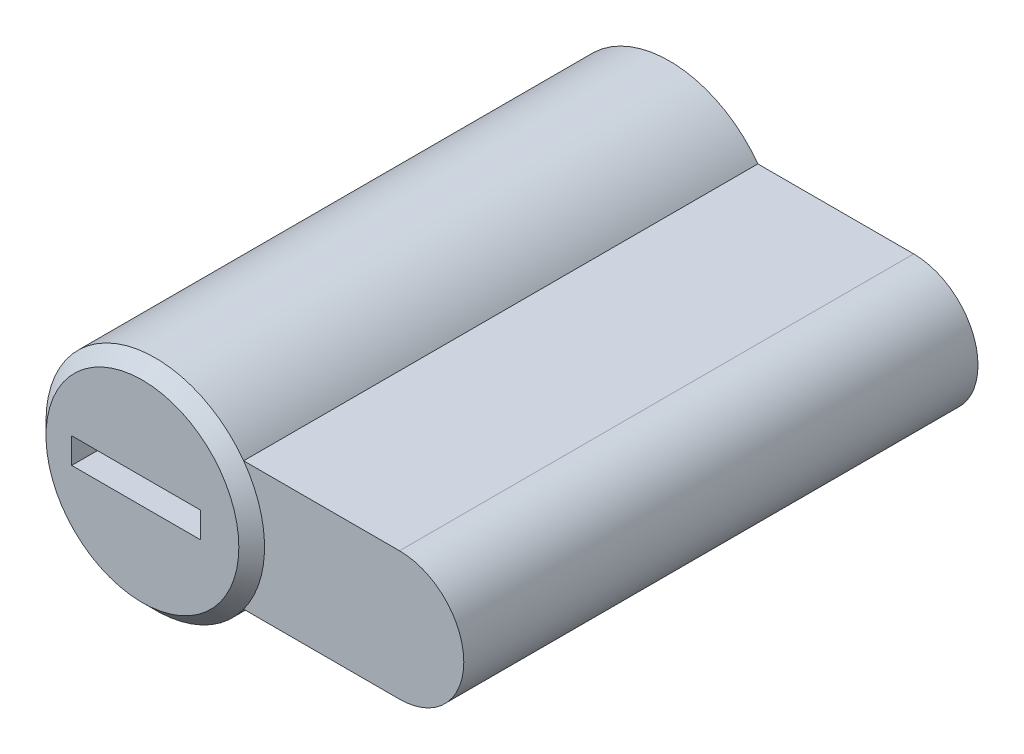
ISO-10303-21;
HEADER;
FILE_DESCRIPTION(('STEP AP214'),'2;1');
FILE_NAME('part.step','',(''),(''),'','','');
FILE_SCHEMA(('AUTOMOTIVE_DESIGN { 1 0 10303 214 1 1 1 1 }'));
ENDSEC;
DATA;
#1=APPLICATION_CONTEXT('core data for automotive mechanical design processes');
#2=APPLICATION_PROTOCOL_DEFINITION('international standard','automotive_design',2000,#1);
#3=PRODUCT_CONTEXT('',#1,'mechanical');
#4=PRODUCT('Part','Part','',(#3));
#5=PRODUCT_RELATED_PRODUCT_CATEGORY('part','',(#4));
#6=PRODUCT_DEFINITION_FORMATION('','',#4);
#7=PRODUCT_DEFINITION_CONTEXT('part definition',#1,'design');
#8=PRODUCT_DEFINITION('design','',#6,#7);
#9=PRODUCT_DEFINITION_SHAPE('','',#8);
#10=(LENGTH_UNIT() NAMED_UNIT(*) SI_UNIT(.MILLI.,.METRE.));
#11=(NAMED_UNIT(*) PLANE_ANGLE_UNIT() SI_UNIT($,.RADIAN.));
#12=(NAMED_UNIT(*) SI_UNIT($,.STERADIAN.) SOLID_ANGLE_UNIT());
#13=UNCERTAINTY_MEASURE_WITH_UNIT(LENGTH_MEASURE(1.E-05),#10,'distance_accuracy_value','');
#14=(GEOMETRIC_REPRESENTATION_CONTEXT(3) GLOBAL_UNCERTAINTY_ASSIGNED_CONTEXT((#13)) GLOBAL_UNIT_ASSIGNED_CONTEXT((#10,
#11,#12)) REPRESENTATION_CONTEXT('',''));
#15=CARTESIAN_POINT('',(0.,0.,0.));
#16=DIRECTION('',(0.,0.,1.));
#17=DIRECTION('',(1.,0.,0.));
#18=AXIS2_PLACEMENT_3D('',#15,#16,#17);
#19=CARTESIAN_POINT('',(0.,0.,-40.));
#20=DIRECTION('',(0.,0.,1.));
#21=DIRECTION('',(0.,1.,0.));
#22=AXIS2_PLACEMENT_3D('',#19,#20,#21);
#23=CYLINDRICAL_SURFACE('',#22,8.5);
#24=DIRECTION('',(0.,0.,1.));
#25=VECTOR('',#24,1.);
#26=CARTESIAN_POINT('',(6.87386354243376,-5.,-40.));
#27=LINE('',#26,#25);
#28=CARTESIAN_POINT('',(6.87386354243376,-5.,-40.));
#29=VERTEX_POINT('',#28);
#30=CARTESIAN_POINT('',(6.87386354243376,-5.,0.));
#31=VERTEX_POINT('',#30);
#32=EDGE_CURVE('E136',#29,#31,#27,.T.);
#33=ORIENTED_EDGE('',*,*,#32,.T.);
#34=CARTESIAN_POINT('',(0.,0.,0.));
#35=DIRECTION('',(0.,0.,1.));
#36=DIRECTION('',(0.,1.,0.));
#37=AXIS2_PLACEMENT_3D('',#34,#35,#36);
#38=CIRCLE('',#37,8.5);
#39=CARTESIAN_POINT('',(6.87386354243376,5.,0.));
#40=VERTEX_POINT('',#39);
#41=EDGE_CURVE('E9',#31,#40,#38,.F.);
#42=ORIENTED_EDGE('',*,*,#41,.T.);
#43=DIRECTION('',(0.,0.,1.));
#44=VECTOR('',#43,1.);
#45=CARTESIAN_POINT('',(6.87386354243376,5.,-40.));
#46=LINE('',#45,#44);
#47=CARTESIAN_POINT('',(6.87386354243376,5.,-40.));
#48=VERTEX_POINT('',#47);
#49=EDGE_CURVE('E36',#48,#40,#46,.T.);
#50=ORIENTED_EDGE('',*,*,#49,.F.);
#51=CARTESIAN_POINT('',(0.,0.,-40.));
#52=DIRECTION('',(0.,0.,1.));
#53=DIRECTION('',(0.,1.,0.));
#54=AXIS2_PLACEMENT_3D('',#51,#52,#53);
#55=CIRCLE('',#54,8.5);
#56=EDGE_CURVE('E125',#48,#29,#55,.T.);
#57=ORIENTED_EDGE('',*,*,#56,.T.);
#58=EDGE_LOOP('',(#33,#42,#50,#57));
#59=FACE_BOUND('',#58,.T.);
#60=ADVANCED_FACE('F14',(#59),#23,.T.);
#61=CARTESIAN_POINT('',(6.87386354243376,5.,-40.));
#62=DIRECTION('',(0.,-1.,0.));
#63=DIRECTION('',(1.,0.,0.));
#64=AXIS2_PLACEMENT_3D('',#61,#62,#63);
#65=PLANE('',#64);
#66=DIRECTION('',(0.,0.,1.));
#67=VECTOR('',#66,1.);
#68=CARTESIAN_POINT('',(19.,5.,-40.));
#69=LINE('',#68,#67);
#70=CARTESIAN_POINT('',(19.,5.,-40.));
#71=VERTEX_POINT('',#70);
#72=CARTESIAN_POINT('',(19.,5.,0.));
#73=VERTEX_POINT('',#72);
#74=EDGE_CURVE('E139',#71,#73,#69,.T.);
#75=ORIENTED_EDGE('',*,*,#74,.F.);
#76=DIRECTION('',(1.,0.,0.));
#77=VECTOR('',#76,1.);
#78=CARTESIAN_POINT('',(6.87386354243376,5.,-40.));
#79=LINE('',#78,#77);
#80=EDGE_CURVE('E133',#48,#71,#79,.T.);
#81=ORIENTED_EDGE('',*,*,#80,.F.);
#82=ORIENTED_EDGE('',*,*,#49,.T.);
#83=DIRECTION('',(1.,0.,0.));
#84=VECTOR('',#83,1.);
#85=CARTESIAN_POINT('',(6.87386354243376,5.,0.));
#86=LINE('',#85,#84);
#87=EDGE_CURVE('E123',#40,#73,#86,.T.);
#88=ORIENTED_EDGE('',*,*,#87,.T.);
#89=EDGE_LOOP('',(#75,#81,#82,#88));
#90=FACE_BOUND('',#89,.T.);
#91=ADVANCED_FACE('F16',(#90),#65,.F.);
#92=CARTESIAN_POINT('',(19.,0.,-40.));
#93=DIRECTION('',(0.,0.,1.));
#94=DIRECTION('',(0.,1.,0.));
#95=AXIS2_PLACEMENT_3D('',#92,#93,#94);
#96=CYLINDRICAL_SURFACE('',#95,5.);
#97=DIRECTION('',(0.,0.,1.));
#98=VECTOR('',#97,1.);
#99=CARTESIAN_POINT('',(19.,-5.,-40.));
#100=LINE('',#99,#98);
#101=CARTESIAN_POINT('',(19.,-5.,-40.));
#102=VERTEX_POINT('',#101);
#103=CARTESIAN_POINT('',(19.,-5.,0.));
#104=VERTEX_POINT('',#103);
#105=EDGE_CURVE('E137',#102,#104,#100,.T.);
#106=ORIENTED_EDGE('',*,*,#105,.F.);
#107=CARTESIAN_POINT('',(19.,0.,-40.));
#108=DIRECTION('',(0.,0.,1.));
#109=DIRECTION('',(0.,1.,0.));
#110=AXIS2_PLACEMENT_3D('',#107,#108,#109);
#111=CIRCLE('',#110,5.);
#112=EDGE_CURVE('E130',#102,#71,#111,.T.);
#113=ORIENTED_EDGE('',*,*,#112,.T.);
#114=ORIENTED_EDGE('',*,*,#74,.T.);
#115=CARTESIAN_POINT('',(19.,0.,0.));
#116=DIRECTION('',(0.,0.,1.));
#117=DIRECTION('',(0.,1.,0.));
#118=AXIS2_PLACEMENT_3D('',#115,#116,#117);
#119=CIRCLE('',#118,5.);
#120=EDGE_CURVE('E120',#104,#73,#119,.T.);
#121=ORIENTED_EDGE('',*,*,#120,.F.);
#122=EDGE_LOOP('',(#106,#113,#114,#121));
#123=FACE_BOUND('',#122,.T.);
#124=ADVANCED_FACE('F172',(#123),#96,.T.);
#125=CARTESIAN_POINT('',(6.87386354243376,-5.,-40.));
#126=DIRECTION('',(0.,-1.,0.));
#127=DIRECTION('',(1.,0.,0.));
#128=AXIS2_PLACEMENT_3D('',#125,#126,#127);
#129=PLANE('',#128);
#130=DIRECTION('',(1.,0.,0.));
#131=VECTOR('',#130,1.);
#132=CARTESIAN_POINT('',(6.87386354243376,-5.,-40.));
#133=LINE('',#132,#131);
#134=EDGE_CURVE('E127',#29,#102,#133,.T.);
#135=ORIENTED_EDGE('',*,*,#134,.T.);
#136=ORIENTED_EDGE('',*,*,#105,.T.);
#137=DIRECTION('',(1.,0.,0.));
#138=VECTOR('',#137,1.);
#139=CARTESIAN_POINT('',(6.87386354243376,-5.,0.));
#140=LINE('',#139,#138);
#141=EDGE_CURVE('E124',#31,#104,#140,.T.);
#142=ORIENTED_EDGE('',*,*,#141,.F.);
#143=ORIENTED_EDGE('',*,*,#32,.F.);
#144=EDGE_LOOP('',(#135,#136,#142,#143));
#145=FACE_BOUND('',#144,.T.);
#146=ADVANCED_FACE('F178',(#145),#129,.T.);
#147=CARTESIAN_POINT('',(0.,0.,-40.));
#148=DIRECTION('',(0.,0.,1.));
#149=DIRECTION('',(0.,1.,0.));
#150=AXIS2_PLACEMENT_3D('',#147,#148,#149);
#151=PLANE('',#150);
#152=ORIENTED_EDGE('',*,*,#56,.F.);
#153=ORIENTED_EDGE('',*,*,#80,.T.);
#154=ORIENTED_EDGE('',*,*,#112,.F.);
#155=ORIENTED_EDGE('',*,*,#134,.F.);
#156=EDGE_LOOP('',(#152,#153,#154,#155));
#157=FACE_BOUND('',#156,.T.);
#158=ADVANCED_FACE('F176',(#157),#151,.F.);
#159=CARTESIAN_POINT('',(0.,0.,0.));
#160=DIRECTION('',(0.,0.,1.));
#161=DIRECTION('',(0.,1.,0.));
#162=AXIS2_PLACEMENT_3D('',#159,#160,#161);
#163=PLANE('',#162);
#164=CARTESIAN_POINT('',(0.,0.,0.));
#165=DIRECTION('',(0.,0.,1.));
#166=DIRECTION('',(0.,1.,0.));
#167=AXIS2_PLACEMENT_3D('',#164,#165,#166);
#168=CIRCLE('',#167,8.5);
#169=EDGE_CURVE('E119',#31,#40,#168,.T.);
#170=ORIENTED_EDGE('',*,*,#169,.F.);
#171=ORIENTED_EDGE('',*,*,#141,.T.);
#172=ORIENTED_EDGE('',*,*,#120,.T.);
#173=ORIENTED_EDGE('',*,*,#87,.F.);
#174=EDGE_LOOP('',(#170,#171,#172,#173));
#175=FACE_BOUND('',#174,.T.);
#176=ADVANCED_FACE('F164',(#175),#163,.T.);
#177=CARTESIAN_POINT('',(0.,0.,1.));
#178=DIRECTION('',(0.,0.,1.));
#179=DIRECTION('',(0.,1.,0.));
#180=AXIS2_PLACEMENT_3D('',#177,#178,#179);
#181=PLANE('',#180);
#182=DIRECTION('',(1.,0.,0.));
#183=VECTOR('',#182,1.);
#184=CARTESIAN_POINT('',(-5.5,-1.,1.));
#185=LINE('',#184,#183);
#186=CARTESIAN_POINT('',(-5.5,-1.,1.));
#187=VERTEX_POINT('',#186);
#188=CARTESIAN_POINT('',(4.5,-1.,1.));
#189=VERTEX_POINT('',#188);
#190=EDGE_CURVE('E29',#187,#189,#185,.T.);
#191=ORIENTED_EDGE('',*,*,#190,.F.);
#192=DIRECTION('',(0.,1.,0.));
#193=VECTOR('',#192,1.);
#194=CARTESIAN_POINT('',(-5.5,-1.,1.));
#195=LINE('',#194,#193);
#196=CARTESIAN_POINT('',(-5.5,1.,1.));
#197=VERTEX_POINT('',#196);
#198=EDGE_CURVE('E101',#187,#197,#195,.T.);
#199=ORIENTED_EDGE('',*,*,#198,.T.);
#200=DIRECTION('',(-1.,0.,0.));
#201=VECTOR('',#200,1.);
#202=CARTESIAN_POINT('',(4.5,1.,1.));
#203=LINE('',#202,#201);
#204=CARTESIAN_POINT('',(4.5,1.,1.));
#205=VERTEX_POINT('',#204);
#206=EDGE_CURVE('E83',#205,#197,#203,.T.);
#207=ORIENTED_EDGE('',*,*,#206,.F.);
#208=DIRECTION('',(0.,-1.,0.));
#209=VECTOR('',#208,1.);
#210=CARTESIAN_POINT('',(4.5,1.,1.));
#211=LINE('',#210,#209);
#212=EDGE_CURVE('E94',#205,#189,#211,.T.);
#213=ORIENTED_EDGE('',*,*,#212,.T.);
#214=EDGE_LOOP('',(#191,#199,#207,#213));
#215=FACE_BOUND('',#214,.T.);
#216=CARTESIAN_POINT('',(0.,0.,1.));
#217=DIRECTION('',(0.,0.,1.));
#218=DIRECTION('',(0.,1.,0.));
#219=AXIS2_PLACEMENT_3D('',#216,#217,#218);
#220=CIRCLE('',#219,7.5);
#221=CARTESIAN_POINT('',(0.,7.5,1.));
#222=VERTEX_POINT('',#221);
#223=EDGE_CURVE('E22',#222,#222,#220,.T.);
#224=ORIENTED_EDGE('',*,*,#223,.T.);
#225=EDGE_LOOP('',(#224));
#226=FACE_BOUND('',#225,.T.);
#227=ADVANCED_FACE('F98',(#215,#226),#181,.T.);
#228=CARTESIAN_POINT('',(0.,0.,1.));
#229=DIRECTION('',(0.,0.,-1.));
#230=DIRECTION('',(0.,-1.,0.));
#231=AXIS2_PLACEMENT_3D('',#228,#229,#230);
#232=CONICAL_SURFACE('',#231,7.5,0.785398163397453);
#233=ORIENTED_EDGE('',*,*,#41,.F.);
#234=ORIENTED_EDGE('',*,*,#169,.T.);
#235=EDGE_LOOP('',(#233,#234));
#236=FACE_BOUND('',#235,.T.);
#237=ORIENTED_EDGE('',*,*,#223,.F.);
#238=EDGE_LOOP('',(#237));
#239=FACE_BOUND('',#238,.T.);
#240=ADVANCED_FACE('F152',(#236,#239),#232,.T.);
#241=CARTESIAN_POINT('',(-5.5,-1.,-2.));
#242=DIRECTION('',(0.,-1.,0.));
#243=DIRECTION('',(1.,0.,0.));
#244=AXIS2_PLACEMENT_3D('',#241,#242,#243);
#245=PLANE('',#244);
#246=DIRECTION('',(0.,0.,1.));
#247=VECTOR('',#246,1.);
#248=CARTESIAN_POINT('',(-5.5,-1.,-2.));
#249=LINE('',#248,#247);
#250=CARTESIAN_POINT('',(-5.5,-1.,-2.));
#251=VERTEX_POINT('',#250);
#252=EDGE_CURVE('E117',#251,#187,#249,.T.);
#253=ORIENTED_EDGE('',*,*,#252,.T.);
#254=ORIENTED_EDGE('',*,*,#190,.T.);
#255=DIRECTION('',(0.,0.,1.));
#256=VECTOR('',#255,1.);
#257=CARTESIAN_POINT('',(4.5,-1.,-2.));
#258=LINE('',#257,#256);
#259=CARTESIAN_POINT('',(4.5,-1.,-2.));
#260=VERTEX_POINT('',#259);
#261=EDGE_CURVE('E91',#260,#189,#258,.T.);
#262=ORIENTED_EDGE('',*,*,#261,.F.);
#263=DIRECTION('',(1.,0.,0.));
#264=VECTOR('',#263,1.);
#265=CARTESIAN_POINT('',(-5.5,-1.,-2.));
#266=LINE('',#265,#264);
#267=EDGE_CURVE('E103',#251,#260,#266,.T.);
#268=ORIENTED_EDGE('',*,*,#267,.F.);
#269=EDGE_LOOP('',(#253,#254,#262,#268));
#270=FACE_BOUND('',#269,.T.);
#271=ADVANCED_FACE('F154',(#270),#245,.F.);
#272=CARTESIAN_POINT('',(-5.5,-1.,-2.));
#273=DIRECTION('',(1.,0.,0.));
#274=DIRECTION('',(0.,0.,-1.));
#275=AXIS2_PLACEMENT_3D('',#272,#273,#274);
#276=PLANE('',#275);
#277=DIRECTION('',(0.,0.,1.));
#278=VECTOR('',#277,1.);
#279=CARTESIAN_POINT('',(-5.5,1.,-2.));
#280=LINE('',#279,#278);
#281=CARTESIAN_POINT('',(-5.5,1.,-2.));
#282=VERTEX_POINT('',#281);
#283=EDGE_CURVE('E90',#282,#197,#280,.T.);
#284=ORIENTED_EDGE('',*,*,#283,.T.);
#285=ORIENTED_EDGE('',*,*,#198,.F.);
#286=ORIENTED_EDGE('',*,*,#252,.F.);
#287=DIRECTION('',(0.,1.,0.));
#288=VECTOR('',#287,1.);
#289=CARTESIAN_POINT('',(-5.5,-1.,-2.));
#290=LINE('',#289,#288);
#291=EDGE_CURVE('E112',#251,#282,#290,.T.);
#292=ORIENTED_EDGE('',*,*,#291,.T.);
#293=EDGE_LOOP('',(#284,#285,#286,#292));
#294=FACE_BOUND('',#293,.T.);
#295=ADVANCED_FACE('F162',(#294),#276,.T.);
#296=CARTESIAN_POINT('',(4.5,1.,-2.));
#297=DIRECTION('',(0.,1.,0.));
#298=DIRECTION('',(0.,0.,-1.));
#299=AXIS2_PLACEMENT_3D('',#296,#297,#298);
#300=PLANE('',#299);
#301=DIRECTION('',(0.,0.,1.));
#302=VECTOR('',#301,1.);
#303=CARTESIAN_POINT('',(4.5,1.,-2.));
#304=LINE('',#303,#302);
#305=CARTESIAN_POINT('',(4.5,1.,-2.));
#306=VERTEX_POINT('',#305);
#307=EDGE_CURVE('E79',#306,#205,#304,.T.);
#308=ORIENTED_EDGE('',*,*,#307,.T.);
#309=ORIENTED_EDGE('',*,*,#206,.T.);
#310=ORIENTED_EDGE('',*,*,#283,.F.);
#311=DIRECTION('',(-1.,0.,0.));
#312=VECTOR('',#311,1.);
#313=CARTESIAN_POINT('',(4.5,1.,-2.));
#314=LINE('',#313,#312);
#315=EDGE_CURVE('E86',#306,#282,#314,.T.);
#316=ORIENTED_EDGE('',*,*,#315,.F.);
#317=EDGE_LOOP('',(#308,#309,#310,#316));
#318=FACE_BOUND('',#317,.T.);
#319=ADVANCED_FACE('F81',(#318),#300,.F.);
#320=CARTESIAN_POINT('',(4.5,1.,-2.));
#321=DIRECTION('',(-1.,0.,0.));
#322=DIRECTION('',(0.,-1.,0.));
#323=AXIS2_PLACEMENT_3D('',#320,#321,#322);
#324=PLANE('',#323);
#325=DIRECTION('',(0.,-1.,0.));
#326=VECTOR('',#325,1.);
#327=CARTESIAN_POINT('',(4.5,1.,-2.));
#328=LINE('',#327,#326);
#329=EDGE_CURVE('E109',#306,#260,#328,.T.);
#330=ORIENTED_EDGE('',*,*,#329,.T.);
#331=ORIENTED_EDGE('',*,*,#261,.T.);
#332=ORIENTED_EDGE('',*,*,#212,.F.);
#333=ORIENTED_EDGE('',*,*,#307,.F.);
#334=EDGE_LOOP('',(#330,#331,#332,#333));
#335=FACE_BOUND('',#334,.T.);
#336=ADVANCED_FACE('F95',(#335),#324,.T.);
#337=CARTESIAN_POINT('',(-5.5,-1.,-2.));
#338=DIRECTION('',(0.,0.,1.));
#339=DIRECTION('',(0.,1.,0.));
#340=AXIS2_PLACEMENT_3D('',#337,#338,#339);
#341=PLANE('',#340);
#342=ORIENTED_EDGE('',*,*,#267,.T.);
#343=ORIENTED_EDGE('',*,*,#329,.F.);
#344=ORIENTED_EDGE('',*,*,#315,.T.);
#345=ORIENTED_EDGE('',*,*,#291,.F.);
#346=EDGE_LOOP('',(#342,#343,#344,#345));
#347=FACE_BOUND('',#346,.T.);
#348=ADVANCED_FACE('F240',(#347),#341,.T.);
#349=CLOSED_SHELL('',(#60,#91,#124,#146,#158,#176,#227,#240,#271,#295,#319,#336,#348));
#350=MANIFOLD_SOLID_BREP('B1',#349);
#351=ADVANCED_BREP_SHAPE_REPRESENTATION('',(#18,#350),#14);
#352=SHAPE_DEFINITION_REPRESENTATION(#9,#351);
ENDSEC;
END-ISO-10303-21;
